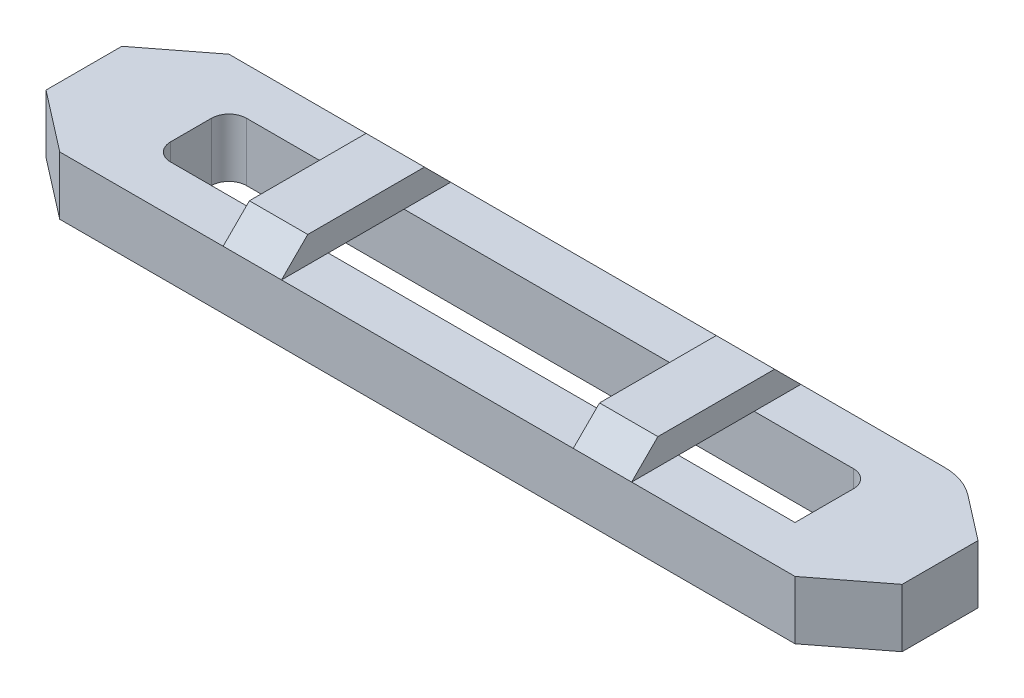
ISO-10303-21;
HEADER;
FILE_DESCRIPTION(('STEP AP214'),'2;1');
FILE_NAME('part.step','',(''),(''),'','','');
FILE_SCHEMA(('AUTOMOTIVE_DESIGN { 1 0 10303 214 1 1 1 1 }'));
ENDSEC;
DATA;
#1=APPLICATION_CONTEXT('core data for automotive mechanical design processes');
#2=APPLICATION_PROTOCOL_DEFINITION('international standard','automotive_design',2000,#1);
#3=PRODUCT_CONTEXT('',#1,'mechanical');
#4=PRODUCT('Part','Part','',(#3));
#5=PRODUCT_RELATED_PRODUCT_CATEGORY('part','',(#4));
#6=PRODUCT_DEFINITION_FORMATION('','',#4);
#7=PRODUCT_DEFINITION_CONTEXT('part definition',#1,'design');
#8=PRODUCT_DEFINITION('design','',#6,#7);
#9=PRODUCT_DEFINITION_SHAPE('','',#8);
#10=(LENGTH_UNIT() NAMED_UNIT(*) SI_UNIT(.MILLI.,.METRE.));
#11=(NAMED_UNIT(*) PLANE_ANGLE_UNIT() SI_UNIT($,.RADIAN.));
#12=(NAMED_UNIT(*) SI_UNIT($,.STERADIAN.) SOLID_ANGLE_UNIT());
#13=UNCERTAINTY_MEASURE_WITH_UNIT(LENGTH_MEASURE(1.E-05),#10,'distance_accuracy_value','');
#14=(GEOMETRIC_REPRESENTATION_CONTEXT(3) GLOBAL_UNCERTAINTY_ASSIGNED_CONTEXT((#13)) GLOBAL_UNIT_ASSIGNED_CONTEXT((#10,
#11,#12)) REPRESENTATION_CONTEXT('',''));
#15=CARTESIAN_POINT('',(0.,0.,0.));
#16=DIRECTION('',(0.,0.,1.));
#17=DIRECTION('',(1.,0.,0.));
#18=AXIS2_PLACEMENT_3D('',#15,#16,#17);
#19=CARTESIAN_POINT('',(-81.7701905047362,10.,0.));
#20=DIRECTION('',(0.,-1.,0.));
#21=DIRECTION('',(0.,0.,-1.));
#22=AXIS2_PLACEMENT_3D('',#19,#20,#21);
#23=PLANE('',#22);
#24=DIRECTION('',(0.,0.,-1.));
#25=VECTOR('',#24,1.);
#26=CARTESIAN_POINT('',(-35.,10.,14.5));
#27=LINE('',#26,#25);
#28=CARTESIAN_POINT('',(-35.,10.,-6.5));
#29=VERTEX_POINT('',#28);
#30=CARTESIAN_POINT('',(-35.,10.,-14.5));
#31=VERTEX_POINT('',#30);
#32=EDGE_CURVE('E243',#29,#31,#27,.T.);
#33=ORIENTED_EDGE('',*,*,#32,.T.);
#34=DIRECTION('',(-1.,0.,0.));
#35=VECTOR('',#34,1.);
#36=CARTESIAN_POINT('',(-63.,10.,-14.5));
#37=LINE('',#36,#35);
#38=CARTESIAN_POINT('',(-63.,10.,-14.5));
#39=VERTEX_POINT('',#38);
#40=EDGE_CURVE('E407',#31,#39,#37,.T.);
#41=ORIENTED_EDGE('',*,*,#40,.T.);
#42=DIRECTION('',(-0.79137144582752,0.,0.611335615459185));
#43=VECTOR('',#42,1.);
#44=CARTESIAN_POINT('',(-63.,10.,-14.5));
#45=LINE('',#44,#43);
#46=CARTESIAN_POINT('',(-73.3559671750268,10.,-6.5));
#47=VERTEX_POINT('',#46);
#48=EDGE_CURVE('E736',#39,#47,#45,.T.);
#49=ORIENTED_EDGE('',*,*,#48,.T.);
#50=DIRECTION('',(0.,0.,1.));
#51=VECTOR('',#50,1.);
#52=CARTESIAN_POINT('',(-73.3559671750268,10.,-6.5));
#53=LINE('',#52,#51);
#54=CARTESIAN_POINT('',(-73.3559671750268,10.,6.5));
#55=VERTEX_POINT('',#54);
#56=EDGE_CURVE('E735',#47,#55,#53,.T.);
#57=ORIENTED_EDGE('',*,*,#56,.T.);
#58=DIRECTION('',(0.79137144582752,0.,0.611335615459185));
#59=VECTOR('',#58,1.);
#60=CARTESIAN_POINT('',(-63.,10.,14.5));
#61=LINE('',#60,#59);
#62=CARTESIAN_POINT('',(-63.,10.,14.5));
#63=VERTEX_POINT('',#62);
#64=EDGE_CURVE('E384',#55,#63,#61,.T.);
#65=ORIENTED_EDGE('',*,*,#64,.T.);
#66=DIRECTION('',(1.,0.,0.));
#67=VECTOR('',#66,1.);
#68=CARTESIAN_POINT('',(-63.,10.,14.5));
#69=LINE('',#68,#67);
#70=CARTESIAN_POINT('',(-35.,10.,14.5));
#71=VERTEX_POINT('',#70);
#72=EDGE_CURVE('E382',#63,#71,#69,.T.);
#73=ORIENTED_EDGE('',*,*,#72,.T.);
#74=CARTESIAN_POINT('',(-35.,10.,6.5));
#75=VERTEX_POINT('',#74);
#76=EDGE_CURVE('E236',#71,#75,#27,.T.);
#77=ORIENTED_EDGE('',*,*,#76,.T.);
#78=DIRECTION('',(1.,0.,0.));
#79=VECTOR('',#78,1.);
#80=CARTESIAN_POINT('',(-52.,10.,6.5));
#81=LINE('',#80,#79);
#82=CARTESIAN_POINT('',(-52.,10.,6.5));
#83=VERTEX_POINT('',#82);
#84=EDGE_CURVE('E358',#83,#75,#81,.T.);
#85=ORIENTED_EDGE('',*,*,#84,.F.);
#86=CARTESIAN_POINT('',(-52.,10.,3.5));
#87=DIRECTION('',(0.,1.,0.));
#88=DIRECTION('',(0.,0.,1.));
#89=AXIS2_PLACEMENT_3D('',#86,#87,#88);
#90=CIRCLE('',#89,3.);
#91=CARTESIAN_POINT('',(-55.,10.,3.49999999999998));
#92=VERTEX_POINT('',#91);
#93=EDGE_CURVE('E360',#92,#83,#90,.T.);
#94=ORIENTED_EDGE('',*,*,#93,.F.);
#95=DIRECTION('',(0.,0.,1.));
#96=VECTOR('',#95,1.);
#97=CARTESIAN_POINT('',(-55.,10.,-3.49999999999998));
#98=LINE('',#97,#96);
#99=CARTESIAN_POINT('',(-55.,10.,-3.49999999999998));
#100=VERTEX_POINT('',#99);
#101=EDGE_CURVE('E790',#100,#92,#98,.T.);
#102=ORIENTED_EDGE('',*,*,#101,.F.);
#103=CARTESIAN_POINT('',(-52.,10.,-3.5));
#104=DIRECTION('',(0.,1.,0.));
#105=DIRECTION('',(0.,0.,-1.));
#106=AXIS2_PLACEMENT_3D('',#103,#104,#105);
#107=CIRCLE('',#106,3.);
#108=CARTESIAN_POINT('',(-52.,10.,-6.5));
#109=VERTEX_POINT('',#108);
#110=EDGE_CURVE('E787',#109,#100,#107,.T.);
#111=ORIENTED_EDGE('',*,*,#110,.F.);
#112=DIRECTION('',(-1.,0.,0.));
#113=VECTOR('',#112,1.);
#114=CARTESIAN_POINT('',(-52.,10.,-6.5));
#115=LINE('',#114,#113);
#116=EDGE_CURVE('E780',#29,#109,#115,.T.);
#117=ORIENTED_EDGE('',*,*,#116,.F.);
#118=EDGE_LOOP('',(#33,#41,#49,#57,#65,#73,#77,#85,#94,#102,#111,#117));
#119=FACE_BOUND('',#118,.T.);
#120=ADVANCED_FACE('F30',(#119),#23,.F.);
#121=CARTESIAN_POINT('',(25.,10.,-14.5));
#122=VERTEX_POINT('',#121);
#123=CARTESIAN_POINT('',(-25.,10.,-14.5));
#124=VERTEX_POINT('',#123);
#125=EDGE_CURVE('E412',#122,#124,#37,.T.);
#126=ORIENTED_EDGE('',*,*,#125,.T.);
#127=DIRECTION('',(0.,0.,-1.));
#128=VECTOR('',#127,1.);
#129=CARTESIAN_POINT('',(-25.,10.,14.5));
#130=LINE('',#129,#128);
#131=CARTESIAN_POINT('',(-25.,10.,-6.5));
#132=VERTEX_POINT('',#131);
#133=EDGE_CURVE('E255',#132,#124,#130,.T.);
#134=ORIENTED_EDGE('',*,*,#133,.F.);
#135=CARTESIAN_POINT('',(25.,10.,-6.5));
#136=VERTEX_POINT('',#135);
#137=EDGE_CURVE('E804',#136,#132,#115,.T.);
#138=ORIENTED_EDGE('',*,*,#137,.F.);
#139=DIRECTION('',(0.,0.,-1.));
#140=VECTOR('',#139,1.);
#141=CARTESIAN_POINT('',(25.,10.,14.5));
#142=LINE('',#141,#140);
#143=EDGE_CURVE('E308',#136,#122,#142,.T.);
#144=ORIENTED_EDGE('',*,*,#143,.T.);
#145=EDGE_LOOP('',(#126,#134,#138,#144));
#146=FACE_BOUND('',#145,.T.);
#147=ADVANCED_FACE('F460',(#146),#23,.F.);
#148=DIRECTION('',(-0.79137144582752,0.,-0.611335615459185));
#149=VECTOR('',#148,1.);
#150=CARTESIAN_POINT('',(63.,10.,-14.5));
#151=LINE('',#150,#149);
#152=CARTESIAN_POINT('',(73.3559671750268,10.,-6.5));
#153=VERTEX_POINT('',#152);
#154=CARTESIAN_POINT('',(65.7006880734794,10.,-12.4137144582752));
#155=VERTEX_POINT('',#154);
#156=EDGE_CURVE('E417',#153,#155,#151,.T.);
#157=ORIENTED_EDGE('',*,*,#156,.T.);
#158=CARTESIAN_POINT('',(59.5873319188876,10.,-4.5));
#159=DIRECTION('',(0.,-1.,0.));
#160=DIRECTION('',(0.,0.,-1.));
#161=AXIS2_PLACEMENT_3D('',#158,#159,#160);
#162=CIRCLE('',#161,10.);
#163=CARTESIAN_POINT('',(59.5873319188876,10.,-14.5));
#164=VERTEX_POINT('',#163);
#165=EDGE_CURVE('E11',#155,#164,#162,.F.);
#166=ORIENTED_EDGE('',*,*,#165,.T.);
#167=CARTESIAN_POINT('',(35.,10.,-14.5));
#168=VERTEX_POINT('',#167);
#169=EDGE_CURVE('E409',#164,#168,#37,.T.);
#170=ORIENTED_EDGE('',*,*,#169,.T.);
#171=DIRECTION('',(0.,0.,-1.));
#172=VECTOR('',#171,1.);
#173=CARTESIAN_POINT('',(35.,10.,14.5));
#174=LINE('',#173,#172);
#175=CARTESIAN_POINT('',(35.,10.,-6.5));
#176=VERTEX_POINT('',#175);
#177=EDGE_CURVE('E275',#176,#168,#174,.T.);
#178=ORIENTED_EDGE('',*,*,#177,.F.);
#179=CARTESIAN_POINT('',(52.,10.,-6.5));
#180=VERTEX_POINT('',#179);
#181=EDGE_CURVE('E784',#180,#176,#115,.T.);
#182=ORIENTED_EDGE('',*,*,#181,.F.);
#183=CARTESIAN_POINT('',(52.,10.,-3.5));
#184=DIRECTION('',(0.,1.,0.));
#185=DIRECTION('',(0.,0.,1.));
#186=AXIS2_PLACEMENT_3D('',#183,#184,#185);
#187=CIRCLE('',#186,3.);
#188=CARTESIAN_POINT('',(55.,10.,-3.49999999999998));
#189=VERTEX_POINT('',#188);
#190=EDGE_CURVE('E778',#189,#180,#187,.T.);
#191=ORIENTED_EDGE('',*,*,#190,.F.);
#192=DIRECTION('',(0.,0.,-1.));
#193=VECTOR('',#192,1.);
#194=CARTESIAN_POINT('',(55.,10.,-3.49999999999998));
#195=LINE('',#194,#193);
#196=CARTESIAN_POINT('',(55.,10.,6.5));
#197=VERTEX_POINT('',#196);
#198=EDGE_CURVE('E756',#197,#189,#195,.T.);
#199=ORIENTED_EDGE('',*,*,#198,.F.);
#200=CARTESIAN_POINT('',(35.,10.,6.5));
#201=VERTEX_POINT('',#200);
#202=EDGE_CURVE('E356',#201,#197,#81,.T.);
#203=ORIENTED_EDGE('',*,*,#202,.F.);
#204=CARTESIAN_POINT('',(35.,10.,14.5));
#205=VERTEX_POINT('',#204);
#206=EDGE_CURVE('E269',#205,#201,#174,.T.);
#207=ORIENTED_EDGE('',*,*,#206,.F.);
#208=CARTESIAN_POINT('',(63.,10.,14.5));
#209=VERTEX_POINT('',#208);
#210=EDGE_CURVE('E392',#205,#209,#69,.T.);
#211=ORIENTED_EDGE('',*,*,#210,.T.);
#212=DIRECTION('',(0.79137144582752,0.,-0.611335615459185));
#213=VECTOR('',#212,1.);
#214=CARTESIAN_POINT('',(63.,10.,14.5));
#215=LINE('',#214,#213);
#216=CARTESIAN_POINT('',(73.3559671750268,10.,6.5));
#217=VERTEX_POINT('',#216);
#218=EDGE_CURVE('E388',#209,#217,#215,.T.);
#219=ORIENTED_EDGE('',*,*,#218,.T.);
#220=DIRECTION('',(0.,0.,-1.));
#221=VECTOR('',#220,1.);
#222=CARTESIAN_POINT('',(73.3559671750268,10.,-6.5));
#223=LINE('',#222,#221);
#224=EDGE_CURVE('E390',#217,#153,#223,.T.);
#225=ORIENTED_EDGE('',*,*,#224,.T.);
#226=EDGE_LOOP('',(#157,#166,#170,#178,#182,#191,#199,#203,#207,#211,#219,#225));
#227=FACE_BOUND('',#226,.T.);
#228=ADVANCED_FACE('F433',(#227),#23,.F.);
#229=CARTESIAN_POINT('',(-25.,10.,6.5));
#230=VERTEX_POINT('',#229);
#231=CARTESIAN_POINT('',(25.,10.,6.5));
#232=VERTEX_POINT('',#231);
#233=EDGE_CURVE('E345',#230,#232,#81,.T.);
#234=ORIENTED_EDGE('',*,*,#233,.F.);
#235=CARTESIAN_POINT('',(-25.,10.,14.5));
#236=VERTEX_POINT('',#235);
#237=EDGE_CURVE('E238',#236,#230,#130,.T.);
#238=ORIENTED_EDGE('',*,*,#237,.F.);
#239=CARTESIAN_POINT('',(25.,10.,14.5));
#240=VERTEX_POINT('',#239);
#241=EDGE_CURVE('E348',#236,#240,#69,.T.);
#242=ORIENTED_EDGE('',*,*,#241,.T.);
#243=EDGE_CURVE('E297',#240,#232,#142,.T.);
#244=ORIENTED_EDGE('',*,*,#243,.T.);
#245=EDGE_LOOP('',(#234,#238,#242,#244));
#246=FACE_BOUND('',#245,.T.);
#247=ADVANCED_FACE('F343',(#246),#23,.F.);
#248=CARTESIAN_POINT('',(-81.7701905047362,0.,0.));
#249=DIRECTION('',(0.,-1.,0.));
#250=DIRECTION('',(0.,0.,-1.));
#251=AXIS2_PLACEMENT_3D('',#248,#249,#250);
#252=PLANE('',#251);
#253=DIRECTION('',(-1.,0.,0.));
#254=VECTOR('',#253,1.);
#255=CARTESIAN_POINT('',(-63.,0.,-14.5));
#256=LINE('',#255,#254);
#257=CARTESIAN_POINT('',(59.5873319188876,0.,-14.5));
#258=VERTEX_POINT('',#257);
#259=CARTESIAN_POINT('',(-63.,0.,-14.5));
#260=VERTEX_POINT('',#259);
#261=EDGE_CURVE('E738',#258,#260,#256,.T.);
#262=ORIENTED_EDGE('',*,*,#261,.F.);
#263=CARTESIAN_POINT('',(59.5873319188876,0.,-4.5));
#264=DIRECTION('',(0.,-1.,0.));
#265=DIRECTION('',(0.,0.,-1.));
#266=AXIS2_PLACEMENT_3D('',#263,#264,#265);
#267=CIRCLE('',#266,10.);
#268=CARTESIAN_POINT('',(65.7006880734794,0.,-12.4137144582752));
#269=VERTEX_POINT('',#268);
#270=EDGE_CURVE('E52',#258,#269,#267,.T.);
#271=ORIENTED_EDGE('',*,*,#270,.T.);
#272=DIRECTION('',(-0.79137144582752,0.,-0.611335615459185));
#273=VECTOR('',#272,1.);
#274=CARTESIAN_POINT('',(63.,0.,-14.5));
#275=LINE('',#274,#273);
#276=CARTESIAN_POINT('',(73.3559671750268,0.,-6.5));
#277=VERTEX_POINT('',#276);
#278=EDGE_CURVE('E446',#277,#269,#275,.T.);
#279=ORIENTED_EDGE('',*,*,#278,.F.);
#280=DIRECTION('',(0.,0.,-1.));
#281=VECTOR('',#280,1.);
#282=CARTESIAN_POINT('',(73.3559671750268,0.,-6.5));
#283=LINE('',#282,#281);
#284=CARTESIAN_POINT('',(73.3559671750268,0.,6.5));
#285=VERTEX_POINT('',#284);
#286=EDGE_CURVE('E442',#285,#277,#283,.T.);
#287=ORIENTED_EDGE('',*,*,#286,.F.);
#288=DIRECTION('',(0.79137144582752,0.,-0.611335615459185));
#289=VECTOR('',#288,1.);
#290=CARTESIAN_POINT('',(63.,0.,14.5));
#291=LINE('',#290,#289);
#292=CARTESIAN_POINT('',(63.,0.,14.5));
#293=VERTEX_POINT('',#292);
#294=EDGE_CURVE('E826',#293,#285,#291,.T.);
#295=ORIENTED_EDGE('',*,*,#294,.F.);
#296=DIRECTION('',(1.,0.,0.));
#297=VECTOR('',#296,1.);
#298=CARTESIAN_POINT('',(-63.,0.,14.5));
#299=LINE('',#298,#297);
#300=CARTESIAN_POINT('',(-63.,0.,14.5));
#301=VERTEX_POINT('',#300);
#302=EDGE_CURVE('E828',#301,#293,#299,.T.);
#303=ORIENTED_EDGE('',*,*,#302,.F.);
#304=DIRECTION('',(0.79137144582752,0.,0.611335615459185));
#305=VECTOR('',#304,1.);
#306=CARTESIAN_POINT('',(-63.,0.,14.5));
#307=LINE('',#306,#305);
#308=CARTESIAN_POINT('',(-73.3559671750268,0.,6.5));
#309=VERTEX_POINT('',#308);
#310=EDGE_CURVE('E830',#309,#301,#307,.T.);
#311=ORIENTED_EDGE('',*,*,#310,.F.);
#312=DIRECTION('',(0.,0.,1.));
#313=VECTOR('',#312,1.);
#314=CARTESIAN_POINT('',(-73.3559671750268,0.,-6.5));
#315=LINE('',#314,#313);
#316=CARTESIAN_POINT('',(-73.3559671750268,0.,-6.5));
#317=VERTEX_POINT('',#316);
#318=EDGE_CURVE('E831',#317,#309,#315,.T.);
#319=ORIENTED_EDGE('',*,*,#318,.F.);
#320=DIRECTION('',(-0.79137144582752,0.,0.611335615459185));
#321=VECTOR('',#320,1.);
#322=CARTESIAN_POINT('',(-63.,0.,-14.5));
#323=LINE('',#322,#321);
#324=EDGE_CURVE('E418',#260,#317,#323,.T.);
#325=ORIENTED_EDGE('',*,*,#324,.F.);
#326=EDGE_LOOP('',(#262,#271,#279,#287,#295,#303,#311,#319,#325));
#327=FACE_BOUND('',#326,.T.);
#328=DIRECTION('',(1.,0.,0.));
#329=VECTOR('',#328,1.);
#330=CARTESIAN_POINT('',(-52.,0.,6.5));
#331=LINE('',#330,#329);
#332=CARTESIAN_POINT('',(-52.,0.,6.5));
#333=VERTEX_POINT('',#332);
#334=CARTESIAN_POINT('',(55.,0.,6.5));
#335=VERTEX_POINT('',#334);
#336=EDGE_CURVE('E753',#333,#335,#331,.T.);
#337=ORIENTED_EDGE('',*,*,#336,.T.);
#338=DIRECTION('',(0.,0.,-1.));
#339=VECTOR('',#338,1.);
#340=CARTESIAN_POINT('',(55.,0.,-3.49999999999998));
#341=LINE('',#340,#339);
#342=CARTESIAN_POINT('',(55.,0.,-3.49999999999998));
#343=VERTEX_POINT('',#342);
#344=EDGE_CURVE('E293',#335,#343,#341,.T.);
#345=ORIENTED_EDGE('',*,*,#344,.T.);
#346=CARTESIAN_POINT('',(52.,0.,-3.5));
#347=DIRECTION('',(0.,1.,0.));
#348=DIRECTION('',(0.,0.,1.));
#349=AXIS2_PLACEMENT_3D('',#346,#347,#348);
#350=CIRCLE('',#349,3.);
#351=CARTESIAN_POINT('',(52.,0.,-6.5));
#352=VERTEX_POINT('',#351);
#353=EDGE_CURVE('E769',#343,#352,#350,.T.);
#354=ORIENTED_EDGE('',*,*,#353,.T.);
#355=DIRECTION('',(-1.,0.,0.));
#356=VECTOR('',#355,1.);
#357=CARTESIAN_POINT('',(-52.,0.,-6.5));
#358=LINE('',#357,#356);
#359=CARTESIAN_POINT('',(-52.,0.,-6.5));
#360=VERTEX_POINT('',#359);
#361=EDGE_CURVE('E766',#352,#360,#358,.T.);
#362=ORIENTED_EDGE('',*,*,#361,.T.);
#363=CARTESIAN_POINT('',(-52.,0.,-3.5));
#364=DIRECTION('',(0.,1.,0.));
#365=DIRECTION('',(0.,0.,-1.));
#366=AXIS2_PLACEMENT_3D('',#363,#364,#365);
#367=CIRCLE('',#366,3.);
#368=CARTESIAN_POINT('',(-55.,0.,-3.49999999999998));
#369=VERTEX_POINT('',#368);
#370=EDGE_CURVE('E763',#360,#369,#367,.T.);
#371=ORIENTED_EDGE('',*,*,#370,.T.);
#372=DIRECTION('',(0.,0.,1.));
#373=VECTOR('',#372,1.);
#374=CARTESIAN_POINT('',(-55.,0.,-3.49999999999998));
#375=LINE('',#374,#373);
#376=CARTESIAN_POINT('',(-55.,0.,3.49999999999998));
#377=VERTEX_POINT('',#376);
#378=EDGE_CURVE('E760',#369,#377,#375,.T.);
#379=ORIENTED_EDGE('',*,*,#378,.T.);
#380=CARTESIAN_POINT('',(-52.,0.,3.5));
#381=DIRECTION('',(0.,1.,0.));
#382=DIRECTION('',(0.,0.,1.));
#383=AXIS2_PLACEMENT_3D('',#380,#381,#382);
#384=CIRCLE('',#383,3.);
#385=EDGE_CURVE('E757',#377,#333,#384,.T.);
#386=ORIENTED_EDGE('',*,*,#385,.T.);
#387=EDGE_LOOP('',(#337,#345,#354,#362,#371,#379,#386));
#388=FACE_BOUND('',#387,.T.);
#389=ADVANCED_FACE('F468',(#327,#388),#252,.T.);
#390=CARTESIAN_POINT('',(-63.,10.,-14.5));
#391=DIRECTION('',(0.611335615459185,0.,0.79137144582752));
#392=DIRECTION('',(0.79137144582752,0.,-0.611335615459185));
#393=AXIS2_PLACEMENT_3D('',#390,#391,#392);
#394=PLANE('',#393);
#395=ORIENTED_EDGE('',*,*,#324,.T.);
#396=DIRECTION('',(0.,-1.,0.));
#397=VECTOR('',#396,1.);
#398=CARTESIAN_POINT('',(-73.3559671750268,10.,-6.5));
#399=LINE('',#398,#397);
#400=EDGE_CURVE('E397',#47,#317,#399,.T.);
#401=ORIENTED_EDGE('',*,*,#400,.F.);
#402=ORIENTED_EDGE('',*,*,#48,.F.);
#403=DIRECTION('',(0.,-1.,0.));
#404=VECTOR('',#403,1.);
#405=CARTESIAN_POINT('',(-63.,10.,-14.5));
#406=LINE('',#405,#404);
#407=EDGE_CURVE('E411',#39,#260,#406,.T.);
#408=ORIENTED_EDGE('',*,*,#407,.T.);
#409=EDGE_LOOP('',(#395,#401,#402,#408));
#410=FACE_BOUND('',#409,.T.);
#411=ADVANCED_FACE('F473',(#410),#394,.F.);
#412=CARTESIAN_POINT('',(-73.3559671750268,10.,-6.5));
#413=DIRECTION('',(1.,0.,0.));
#414=DIRECTION('',(0.,0.,-1.));
#415=AXIS2_PLACEMENT_3D('',#412,#413,#414);
#416=PLANE('',#415);
#417=ORIENTED_EDGE('',*,*,#318,.T.);
#418=DIRECTION('',(0.,-1.,0.));
#419=VECTOR('',#418,1.);
#420=CARTESIAN_POINT('',(-73.3559671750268,10.,6.5));
#421=LINE('',#420,#419);
#422=EDGE_CURVE('E811',#55,#309,#421,.T.);
#423=ORIENTED_EDGE('',*,*,#422,.F.);
#424=ORIENTED_EDGE('',*,*,#56,.F.);
#425=ORIENTED_EDGE('',*,*,#400,.T.);
#426=EDGE_LOOP('',(#417,#423,#424,#425));
#427=FACE_BOUND('',#426,.T.);
#428=ADVANCED_FACE('F619',(#427),#416,.F.);
#429=CARTESIAN_POINT('',(-63.,10.,14.5));
#430=DIRECTION('',(0.611335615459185,0.,-0.79137144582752));
#431=DIRECTION('',(-0.79137144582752,0.,-0.611335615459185));
#432=AXIS2_PLACEMENT_3D('',#429,#430,#431);
#433=PLANE('',#432);
#434=ORIENTED_EDGE('',*,*,#310,.T.);
#435=DIRECTION('',(0.,-1.,0.));
#436=VECTOR('',#435,1.);
#437=CARTESIAN_POINT('',(-63.,10.,14.5));
#438=LINE('',#437,#436);
#439=EDGE_CURVE('E815',#63,#301,#438,.T.);
#440=ORIENTED_EDGE('',*,*,#439,.F.);
#441=ORIENTED_EDGE('',*,*,#64,.F.);
#442=ORIENTED_EDGE('',*,*,#422,.T.);
#443=EDGE_LOOP('',(#434,#440,#441,#442));
#444=FACE_BOUND('',#443,.T.);
#445=ADVANCED_FACE('F501',(#444),#433,.F.);
#446=CARTESIAN_POINT('',(-63.,10.,14.5));
#447=DIRECTION('',(0.,0.,-1.));
#448=DIRECTION('',(-1.,0.,0.));
#449=AXIS2_PLACEMENT_3D('',#446,#447,#448);
#450=PLANE('',#449);
#451=ORIENTED_EDGE('',*,*,#302,.T.);
#452=DIRECTION('',(0.,-1.,0.));
#453=VECTOR('',#452,1.);
#454=CARTESIAN_POINT('',(63.,10.,14.5));
#455=LINE('',#454,#453);
#456=EDGE_CURVE('E734',#209,#293,#455,.T.);
#457=ORIENTED_EDGE('',*,*,#456,.F.);
#458=ORIENTED_EDGE('',*,*,#210,.F.);
#459=DIRECTION('',(-1.,0.,0.));
#460=VECTOR('',#459,1.);
#461=CARTESIAN_POINT('',(35.,10.,14.5));
#462=LINE('',#461,#460);
#463=EDGE_CURVE('E290',#205,#240,#462,.T.);
#464=ORIENTED_EDGE('',*,*,#463,.T.);
#465=ORIENTED_EDGE('',*,*,#241,.F.);
#466=DIRECTION('',(1.,0.,0.));
#467=VECTOR('',#466,1.);
#468=CARTESIAN_POINT('',(-35.,10.,14.5));
#469=LINE('',#468,#467);
#470=EDGE_CURVE('E247',#71,#236,#469,.T.);
#471=ORIENTED_EDGE('',*,*,#470,.F.);
#472=ORIENTED_EDGE('',*,*,#72,.F.);
#473=ORIENTED_EDGE('',*,*,#439,.T.);
#474=EDGE_LOOP('',(#451,#457,#458,#464,#465,#471,#472,#473));
#475=FACE_BOUND('',#474,.T.);
#476=ADVANCED_FACE('F496',(#475),#450,.F.);
#477=CARTESIAN_POINT('',(63.,10.,14.5));
#478=DIRECTION('',(-0.611335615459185,0.,-0.79137144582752));
#479=DIRECTION('',(-0.79137144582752,0.,0.611335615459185));
#480=AXIS2_PLACEMENT_3D('',#477,#478,#479);
#481=PLANE('',#480);
#482=ORIENTED_EDGE('',*,*,#294,.T.);
#483=DIRECTION('',(0.,-1.,0.));
#484=VECTOR('',#483,1.);
#485=CARTESIAN_POINT('',(73.3559671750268,10.,6.5));
#486=LINE('',#485,#484);
#487=EDGE_CURVE('E443',#217,#285,#486,.T.);
#488=ORIENTED_EDGE('',*,*,#487,.F.);
#489=ORIENTED_EDGE('',*,*,#218,.F.);
#490=ORIENTED_EDGE('',*,*,#456,.T.);
#491=EDGE_LOOP('',(#482,#488,#489,#490));
#492=FACE_BOUND('',#491,.T.);
#493=ADVANCED_FACE('F457',(#492),#481,.F.);
#494=CARTESIAN_POINT('',(73.3559671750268,10.,-6.5));
#495=DIRECTION('',(-1.,0.,0.));
#496=DIRECTION('',(0.,0.,1.));
#497=AXIS2_PLACEMENT_3D('',#494,#495,#496);
#498=PLANE('',#497);
#499=ORIENTED_EDGE('',*,*,#286,.T.);
#500=DIRECTION('',(0.,-1.,0.));
#501=VECTOR('',#500,1.);
#502=CARTESIAN_POINT('',(73.3559671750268,10.,-6.5));
#503=LINE('',#502,#501);
#504=EDGE_CURVE('E439',#153,#277,#503,.T.);
#505=ORIENTED_EDGE('',*,*,#504,.F.);
#506=ORIENTED_EDGE('',*,*,#224,.F.);
#507=ORIENTED_EDGE('',*,*,#487,.T.);
#508=EDGE_LOOP('',(#499,#505,#506,#507));
#509=FACE_BOUND('',#508,.T.);
#510=ADVANCED_FACE('F440',(#509),#498,.F.);
#511=CARTESIAN_POINT('',(63.,10.,-14.5));
#512=DIRECTION('',(-0.611335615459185,0.,0.79137144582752));
#513=DIRECTION('',(0.79137144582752,0.,0.611335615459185));
#514=AXIS2_PLACEMENT_3D('',#511,#512,#513);
#515=PLANE('',#514);
#516=ORIENTED_EDGE('',*,*,#278,.T.);
#517=DIRECTION('',(0.,-1.,0.));
#518=VECTOR('',#517,1.);
#519=CARTESIAN_POINT('',(65.7006880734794,10.,-12.4137144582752));
#520=LINE('',#519,#518);
#521=EDGE_CURVE('E38',#269,#155,#520,.F.);
#522=ORIENTED_EDGE('',*,*,#521,.T.);
#523=ORIENTED_EDGE('',*,*,#156,.F.);
#524=ORIENTED_EDGE('',*,*,#504,.T.);
#525=EDGE_LOOP('',(#516,#522,#523,#524));
#526=FACE_BOUND('',#525,.T.);
#527=ADVANCED_FACE('F445',(#526),#515,.F.);
#528=CARTESIAN_POINT('',(-63.,10.,-14.5));
#529=DIRECTION('',(0.,0.,1.));
#530=DIRECTION('',(1.,0.,0.));
#531=AXIS2_PLACEMENT_3D('',#528,#529,#530);
#532=PLANE('',#531);
#533=ORIENTED_EDGE('',*,*,#169,.F.);
#534=DIRECTION('',(0.,-1.,0.));
#535=VECTOR('',#534,1.);
#536=CARTESIAN_POINT('',(59.5873319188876,10.,-14.5));
#537=LINE('',#536,#535);
#538=EDGE_CURVE('E310',#164,#258,#537,.T.);
#539=ORIENTED_EDGE('',*,*,#538,.T.);
#540=ORIENTED_EDGE('',*,*,#261,.T.);
#541=ORIENTED_EDGE('',*,*,#407,.F.);
#542=ORIENTED_EDGE('',*,*,#40,.F.);
#543=DIRECTION('',(1.,0.,0.));
#544=VECTOR('',#543,1.);
#545=CARTESIAN_POINT('',(-35.,10.,-14.5));
#546=LINE('',#545,#544);
#547=EDGE_CURVE('E259',#31,#124,#546,.T.);
#548=ORIENTED_EDGE('',*,*,#547,.T.);
#549=ORIENTED_EDGE('',*,*,#125,.F.);
#550=DIRECTION('',(-1.,0.,0.));
#551=VECTOR('',#550,1.);
#552=CARTESIAN_POINT('',(35.,10.,-14.5));
#553=LINE('',#552,#551);
#554=EDGE_CURVE('E294',#168,#122,#553,.T.);
#555=ORIENTED_EDGE('',*,*,#554,.F.);
#556=EDGE_LOOP('',(#533,#539,#540,#541,#542,#548,#549,#555));
#557=FACE_BOUND('',#556,.T.);
#558=ADVANCED_FACE('F448',(#557),#532,.F.);
#559=CARTESIAN_POINT('',(55.,10.,-3.49999999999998));
#560=DIRECTION('',(-1.,0.,0.));
#561=DIRECTION('',(0.,0.,1.));
#562=AXIS2_PLACEMENT_3D('',#559,#560,#561);
#563=PLANE('',#562);
#564=ORIENTED_EDGE('',*,*,#344,.F.);
#565=DIRECTION('',(0.,-1.,0.));
#566=VECTOR('',#565,1.);
#567=CARTESIAN_POINT('',(55.,10.,6.5));
#568=LINE('',#567,#566);
#569=EDGE_CURVE('E364',#197,#335,#568,.T.);
#570=ORIENTED_EDGE('',*,*,#569,.F.);
#571=ORIENTED_EDGE('',*,*,#198,.T.);
#572=DIRECTION('',(0.,-1.,0.));
#573=VECTOR('',#572,1.);
#574=CARTESIAN_POINT('',(55.,10.,-3.49999999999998));
#575=LINE('',#574,#573);
#576=EDGE_CURVE('E741',#189,#343,#575,.T.);
#577=ORIENTED_EDGE('',*,*,#576,.T.);
#578=EDGE_LOOP('',(#564,#570,#571,#577));
#579=FACE_BOUND('',#578,.T.);
#580=ADVANCED_FACE('F454',(#579),#563,.T.);
#581=CARTESIAN_POINT('',(52.,10.,-3.5));
#582=DIRECTION('',(0.,-1.,0.));
#583=DIRECTION('',(0.,0.,-1.));
#584=AXIS2_PLACEMENT_3D('',#581,#582,#583);
#585=CYLINDRICAL_SURFACE('',#584,3.);
#586=ORIENTED_EDGE('',*,*,#353,.F.);
#587=ORIENTED_EDGE('',*,*,#576,.F.);
#588=ORIENTED_EDGE('',*,*,#190,.T.);
#589=DIRECTION('',(0.,-1.,0.));
#590=VECTOR('',#589,1.);
#591=CARTESIAN_POINT('',(52.,10.,-6.5));
#592=LINE('',#591,#590);
#593=EDGE_CURVE('E744',#180,#352,#592,.T.);
#594=ORIENTED_EDGE('',*,*,#593,.T.);
#595=EDGE_LOOP('',(#586,#587,#588,#594));
#596=FACE_BOUND('',#595,.T.);
#597=ADVANCED_FACE('F516',(#596),#585,.F.);
#598=CARTESIAN_POINT('',(-52.,10.,-6.5));
#599=DIRECTION('',(0.,0.,1.));
#600=DIRECTION('',(1.,0.,0.));
#601=AXIS2_PLACEMENT_3D('',#598,#599,#600);
#602=PLANE('',#601);
#603=ORIENTED_EDGE('',*,*,#361,.F.);
#604=ORIENTED_EDGE('',*,*,#593,.F.);
#605=ORIENTED_EDGE('',*,*,#181,.T.);
#606=EDGE_CURVE('E788',#176,#136,#115,.T.);
#607=ORIENTED_EDGE('',*,*,#606,.T.);
#608=ORIENTED_EDGE('',*,*,#137,.T.);
#609=DIRECTION('',(1.,0.,0.));
#610=VECTOR('',#609,1.);
#611=CARTESIAN_POINT('',(-52.,10.,-6.5));
#612=LINE('',#611,#610);
#613=EDGE_CURVE('E225',#29,#132,#612,.T.);
#614=ORIENTED_EDGE('',*,*,#613,.F.);
#615=ORIENTED_EDGE('',*,*,#116,.T.);
#616=DIRECTION('',(0.,-1.,0.));
#617=VECTOR('',#616,1.);
#618=CARTESIAN_POINT('',(-52.,10.,-6.5));
#619=LINE('',#618,#617);
#620=EDGE_CURVE('E746',#109,#360,#619,.T.);
#621=ORIENTED_EDGE('',*,*,#620,.T.);
#622=EDGE_LOOP('',(#603,#604,#605,#607,#608,#614,#615,#621));
#623=FACE_BOUND('',#622,.T.);
#624=ADVANCED_FACE('F510',(#623),#602,.T.);
#625=CARTESIAN_POINT('',(-52.,10.,-3.5));
#626=DIRECTION('',(0.,-1.,0.));
#627=DIRECTION('',(0.,0.,-1.));
#628=AXIS2_PLACEMENT_3D('',#625,#626,#627);
#629=CYLINDRICAL_SURFACE('',#628,3.);
#630=ORIENTED_EDGE('',*,*,#370,.F.);
#631=ORIENTED_EDGE('',*,*,#620,.F.);
#632=ORIENTED_EDGE('',*,*,#110,.T.);
#633=DIRECTION('',(0.,-1.,0.));
#634=VECTOR('',#633,1.);
#635=CARTESIAN_POINT('',(-55.,10.,-3.49999999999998));
#636=LINE('',#635,#634);
#637=EDGE_CURVE('E748',#100,#369,#636,.T.);
#638=ORIENTED_EDGE('',*,*,#637,.T.);
#639=EDGE_LOOP('',(#630,#631,#632,#638));
#640=FACE_BOUND('',#639,.T.);
#641=ADVANCED_FACE('F515',(#640),#629,.F.);
#642=CARTESIAN_POINT('',(-55.,10.,-3.49999999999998));
#643=DIRECTION('',(1.,0.,0.));
#644=DIRECTION('',(0.,0.,-1.));
#645=AXIS2_PLACEMENT_3D('',#642,#643,#644);
#646=PLANE('',#645);
#647=ORIENTED_EDGE('',*,*,#378,.F.);
#648=ORIENTED_EDGE('',*,*,#637,.F.);
#649=ORIENTED_EDGE('',*,*,#101,.T.);
#650=DIRECTION('',(0.,-1.,0.));
#651=VECTOR('',#650,1.);
#652=CARTESIAN_POINT('',(-55.,10.,3.49999999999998));
#653=LINE('',#652,#651);
#654=EDGE_CURVE('E750',#92,#377,#653,.T.);
#655=ORIENTED_EDGE('',*,*,#654,.T.);
#656=EDGE_LOOP('',(#647,#648,#649,#655));
#657=FACE_BOUND('',#656,.T.);
#658=ADVANCED_FACE('F663',(#657),#646,.T.);
#659=CARTESIAN_POINT('',(-52.,10.,3.5));
#660=DIRECTION('',(0.,-1.,0.));
#661=DIRECTION('',(0.,0.,-1.));
#662=AXIS2_PLACEMENT_3D('',#659,#660,#661);
#663=CYLINDRICAL_SURFACE('',#662,3.);
#664=ORIENTED_EDGE('',*,*,#385,.F.);
#665=ORIENTED_EDGE('',*,*,#654,.F.);
#666=ORIENTED_EDGE('',*,*,#93,.T.);
#667=DIRECTION('',(0.,-1.,0.));
#668=VECTOR('',#667,1.);
#669=CARTESIAN_POINT('',(-52.,10.,6.5));
#670=LINE('',#669,#668);
#671=EDGE_CURVE('E367',#83,#333,#670,.T.);
#672=ORIENTED_EDGE('',*,*,#671,.T.);
#673=EDGE_LOOP('',(#664,#665,#666,#672));
#674=FACE_BOUND('',#673,.T.);
#675=ADVANCED_FACE('F530',(#674),#663,.F.);
#676=CARTESIAN_POINT('',(-52.,10.,6.5));
#677=DIRECTION('',(0.,0.,-1.));
#678=DIRECTION('',(-1.,0.,0.));
#679=AXIS2_PLACEMENT_3D('',#676,#677,#678);
#680=PLANE('',#679);
#681=ORIENTED_EDGE('',*,*,#336,.F.);
#682=ORIENTED_EDGE('',*,*,#671,.F.);
#683=ORIENTED_EDGE('',*,*,#84,.T.);
#684=EDGE_CURVE('E359',#75,#230,#81,.T.);
#685=ORIENTED_EDGE('',*,*,#684,.T.);
#686=ORIENTED_EDGE('',*,*,#233,.T.);
#687=EDGE_CURVE('E351',#232,#201,#81,.T.);
#688=ORIENTED_EDGE('',*,*,#687,.T.);
#689=ORIENTED_EDGE('',*,*,#202,.T.);
#690=ORIENTED_EDGE('',*,*,#569,.T.);
#691=EDGE_LOOP('',(#681,#682,#683,#685,#686,#688,#689,#690));
#692=FACE_BOUND('',#691,.T.);
#693=ADVANCED_FACE('F370',(#692),#680,.T.);
#694=CARTESIAN_POINT('',(35.,14.5,10.));
#695=DIRECTION('',(0.,-0.707106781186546,-0.707106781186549));
#696=DIRECTION('',(0.,0.707106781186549,-0.707106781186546));
#697=AXIS2_PLACEMENT_3D('',#694,#695,#696);
#698=PLANE('',#697);
#699=DIRECTION('',(0.,-0.707106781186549,0.707106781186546));
#700=VECTOR('',#699,1.);
#701=CARTESIAN_POINT('',(25.,14.5,10.));
#702=LINE('',#701,#700);
#703=CARTESIAN_POINT('',(25.,14.5,10.));
#704=VERTEX_POINT('',#703);
#705=EDGE_CURVE('E264',#704,#240,#702,.T.);
#706=ORIENTED_EDGE('',*,*,#705,.T.);
#707=ORIENTED_EDGE('',*,*,#463,.F.);
#708=DIRECTION('',(0.,-0.707106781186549,0.707106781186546));
#709=VECTOR('',#708,1.);
#710=CARTESIAN_POINT('',(35.,14.5,10.));
#711=LINE('',#710,#709);
#712=CARTESIAN_POINT('',(35.,14.5,10.));
#713=VERTEX_POINT('',#712);
#714=EDGE_CURVE('E270',#713,#205,#711,.T.);
#715=ORIENTED_EDGE('',*,*,#714,.F.);
#716=DIRECTION('',(-1.,0.,0.));
#717=VECTOR('',#716,1.);
#718=CARTESIAN_POINT('',(35.,14.5,10.));
#719=LINE('',#718,#717);
#720=EDGE_CURVE('E328',#713,#704,#719,.T.);
#721=ORIENTED_EDGE('',*,*,#720,.T.);
#722=EDGE_LOOP('',(#706,#707,#715,#721));
#723=FACE_BOUND('',#722,.T.);
#724=ADVANCED_FACE('F334',(#723),#698,.F.);
#725=CARTESIAN_POINT('',(35.,10.,14.5));
#726=DIRECTION('',(0.,1.,0.));
#727=DIRECTION('',(0.,0.,1.));
#728=AXIS2_PLACEMENT_3D('',#725,#726,#727);
#729=PLANE('',#728);
#730=ORIENTED_EDGE('',*,*,#687,.F.);
#731=EDGE_CURVE('E301',#232,#136,#142,.T.);
#732=ORIENTED_EDGE('',*,*,#731,.T.);
#733=ORIENTED_EDGE('',*,*,#606,.F.);
#734=EDGE_CURVE('E265',#201,#176,#174,.T.);
#735=ORIENTED_EDGE('',*,*,#734,.F.);
#736=EDGE_LOOP('',(#730,#732,#733,#735));
#737=FACE_BOUND('',#736,.T.);
#738=ADVANCED_FACE('F352',(#737),#729,.F.);
#739=CARTESIAN_POINT('',(35.,10.,-14.5));
#740=DIRECTION('',(0.,-0.707106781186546,0.707106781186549));
#741=DIRECTION('',(0.,-0.707106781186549,-0.707106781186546));
#742=AXIS2_PLACEMENT_3D('',#739,#740,#741);
#743=PLANE('',#742);
#744=DIRECTION('',(0.,0.707106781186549,0.707106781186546));
#745=VECTOR('',#744,1.);
#746=CARTESIAN_POINT('',(25.,10.,-14.5));
#747=LINE('',#746,#745);
#748=CARTESIAN_POINT('',(25.,14.5,-10.));
#749=VERTEX_POINT('',#748);
#750=EDGE_CURVE('E300',#122,#749,#747,.T.);
#751=ORIENTED_EDGE('',*,*,#750,.T.);
#752=DIRECTION('',(-1.,0.,0.));
#753=VECTOR('',#752,1.);
#754=CARTESIAN_POINT('',(35.,14.5,-10.));
#755=LINE('',#754,#753);
#756=CARTESIAN_POINT('',(35.,14.5,-10.));
#757=VERTEX_POINT('',#756);
#758=EDGE_CURVE('E313',#757,#749,#755,.T.);
#759=ORIENTED_EDGE('',*,*,#758,.F.);
#760=DIRECTION('',(0.,0.707106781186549,0.707106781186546));
#761=VECTOR('',#760,1.);
#762=CARTESIAN_POINT('',(35.,10.,-14.5));
#763=LINE('',#762,#761);
#764=EDGE_CURVE('E282',#168,#757,#763,.T.);
#765=ORIENTED_EDGE('',*,*,#764,.F.);
#766=ORIENTED_EDGE('',*,*,#554,.T.);
#767=EDGE_LOOP('',(#751,#759,#765,#766));
#768=FACE_BOUND('',#767,.T.);
#769=ADVANCED_FACE('F696',(#768),#743,.F.);
#770=CARTESIAN_POINT('',(35.,14.5,-10.));
#771=DIRECTION('',(0.,-1.,0.));
#772=DIRECTION('',(0.,0.,-1.));
#773=AXIS2_PLACEMENT_3D('',#770,#771,#772);
#774=PLANE('',#773);
#775=DIRECTION('',(0.,0.,1.));
#776=VECTOR('',#775,1.);
#777=CARTESIAN_POINT('',(25.,14.5,-10.));
#778=LINE('',#777,#776);
#779=EDGE_CURVE('E287',#749,#704,#778,.T.);
#780=ORIENTED_EDGE('',*,*,#779,.T.);
#781=ORIENTED_EDGE('',*,*,#720,.F.);
#782=DIRECTION('',(0.,0.,1.));
#783=VECTOR('',#782,1.);
#784=CARTESIAN_POINT('',(35.,14.5,-10.));
#785=LINE('',#784,#783);
#786=EDGE_CURVE('E271',#757,#713,#785,.T.);
#787=ORIENTED_EDGE('',*,*,#786,.F.);
#788=ORIENTED_EDGE('',*,*,#758,.T.);
#789=EDGE_LOOP('',(#780,#781,#787,#788));
#790=FACE_BOUND('',#789,.T.);
#791=ADVANCED_FACE('F326',(#790),#774,.F.);
#792=CARTESIAN_POINT('',(35.,24.5000000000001,0.));
#793=DIRECTION('',(-1.,0.,0.));
#794=DIRECTION('',(0.,0.,1.));
#795=AXIS2_PLACEMENT_3D('',#792,#793,#794);
#796=PLANE('',#795);
#797=ORIENTED_EDGE('',*,*,#714,.T.);
#798=ORIENTED_EDGE('',*,*,#206,.T.);
#799=ORIENTED_EDGE('',*,*,#734,.T.);
#800=ORIENTED_EDGE('',*,*,#177,.T.);
#801=ORIENTED_EDGE('',*,*,#764,.T.);
#802=ORIENTED_EDGE('',*,*,#786,.T.);
#803=EDGE_LOOP('',(#797,#798,#799,#800,#801,#802));
#804=FACE_BOUND('',#803,.T.);
#805=ADVANCED_FACE('F713',(#804),#796,.F.);
#806=CARTESIAN_POINT('',(25.,24.5000000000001,0.));
#807=DIRECTION('',(-1.,0.,0.));
#808=DIRECTION('',(0.,0.,1.));
#809=AXIS2_PLACEMENT_3D('',#806,#807,#808);
#810=PLANE('',#809);
#811=ORIENTED_EDGE('',*,*,#705,.F.);
#812=ORIENTED_EDGE('',*,*,#779,.F.);
#813=ORIENTED_EDGE('',*,*,#750,.F.);
#814=ORIENTED_EDGE('',*,*,#143,.F.);
#815=ORIENTED_EDGE('',*,*,#731,.F.);
#816=ORIENTED_EDGE('',*,*,#243,.F.);
#817=EDGE_LOOP('',(#811,#812,#813,#814,#815,#816));
#818=FACE_BOUND('',#817,.T.);
#819=ADVANCED_FACE('F337',(#818),#810,.T.);
#820=CARTESIAN_POINT('',(-35.,14.5,10.));
#821=DIRECTION('',(0.,0.707106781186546,0.707106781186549));
#822=DIRECTION('',(0.,-0.707106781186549,0.707106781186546));
#823=AXIS2_PLACEMENT_3D('',#820,#821,#822);
#824=PLANE('',#823);
#825=DIRECTION('',(0.,-0.707106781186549,0.707106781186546));
#826=VECTOR('',#825,1.);
#827=CARTESIAN_POINT('',(-25.,14.5,10.));
#828=LINE('',#827,#826);
#829=CARTESIAN_POINT('',(-25.,14.5,10.));
#830=VERTEX_POINT('',#829);
#831=EDGE_CURVE('E220',#830,#236,#828,.T.);
#832=ORIENTED_EDGE('',*,*,#831,.F.);
#833=DIRECTION('',(1.,0.,0.));
#834=VECTOR('',#833,1.);
#835=CARTESIAN_POINT('',(-35.,14.5,10.));
#836=LINE('',#835,#834);
#837=CARTESIAN_POINT('',(-35.,14.5,10.));
#838=VERTEX_POINT('',#837);
#839=EDGE_CURVE('E214',#838,#830,#836,.T.);
#840=ORIENTED_EDGE('',*,*,#839,.F.);
#841=DIRECTION('',(0.,-0.707106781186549,0.707106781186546));
#842=VECTOR('',#841,1.);
#843=CARTESIAN_POINT('',(-35.,14.5,10.));
#844=LINE('',#843,#842);
#845=EDGE_CURVE('E217',#838,#71,#844,.T.);
#846=ORIENTED_EDGE('',*,*,#845,.T.);
#847=ORIENTED_EDGE('',*,*,#470,.T.);
#848=EDGE_LOOP('',(#832,#840,#846,#847));
#849=FACE_BOUND('',#848,.T.);
#850=ADVANCED_FACE('F216',(#849),#824,.T.);
#851=CARTESIAN_POINT('',(-35.,14.5,-10.));
#852=DIRECTION('',(0.,1.,0.));
#853=DIRECTION('',(0.,0.,1.));
#854=AXIS2_PLACEMENT_3D('',#851,#852,#853);
#855=PLANE('',#854);
#856=DIRECTION('',(0.,0.,1.));
#857=VECTOR('',#856,1.);
#858=CARTESIAN_POINT('',(-25.,14.5,-10.));
#859=LINE('',#858,#857);
#860=CARTESIAN_POINT('',(-25.,14.5,-10.));
#861=VERTEX_POINT('',#860);
#862=EDGE_CURVE('E250',#861,#830,#859,.T.);
#863=ORIENTED_EDGE('',*,*,#862,.F.);
#864=DIRECTION('',(1.,0.,0.));
#865=VECTOR('',#864,1.);
#866=CARTESIAN_POINT('',(-35.,14.5,-10.));
#867=LINE('',#866,#865);
#868=CARTESIAN_POINT('',(-35.,14.5,-10.));
#869=VERTEX_POINT('',#868);
#870=EDGE_CURVE('E226',#869,#861,#867,.T.);
#871=ORIENTED_EDGE('',*,*,#870,.F.);
#872=DIRECTION('',(0.,0.,1.));
#873=VECTOR('',#872,1.);
#874=CARTESIAN_POINT('',(-35.,14.5,-10.));
#875=LINE('',#874,#873);
#876=EDGE_CURVE('E232',#869,#838,#875,.T.);
#877=ORIENTED_EDGE('',*,*,#876,.T.);
#878=ORIENTED_EDGE('',*,*,#839,.T.);
#879=EDGE_LOOP('',(#863,#871,#877,#878));
#880=FACE_BOUND('',#879,.T.);
#881=ADVANCED_FACE('F240',(#880),#855,.T.);
#882=CARTESIAN_POINT('',(-35.,10.,-14.5));
#883=DIRECTION('',(0.,0.707106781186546,-0.707106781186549));
#884=DIRECTION('',(0.,0.707106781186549,0.707106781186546));
#885=AXIS2_PLACEMENT_3D('',#882,#883,#884);
#886=PLANE('',#885);
#887=DIRECTION('',(0.,0.707106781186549,0.707106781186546));
#888=VECTOR('',#887,1.);
#889=CARTESIAN_POINT('',(-25.,10.,-14.5));
#890=LINE('',#889,#888);
#891=EDGE_CURVE('E252',#124,#861,#890,.T.);
#892=ORIENTED_EDGE('',*,*,#891,.F.);
#893=ORIENTED_EDGE('',*,*,#547,.F.);
#894=DIRECTION('',(0.,0.707106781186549,0.707106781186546));
#895=VECTOR('',#894,1.);
#896=CARTESIAN_POINT('',(-35.,10.,-14.5));
#897=LINE('',#896,#895);
#898=EDGE_CURVE('E241',#31,#869,#897,.T.);
#899=ORIENTED_EDGE('',*,*,#898,.T.);
#900=ORIENTED_EDGE('',*,*,#870,.T.);
#901=EDGE_LOOP('',(#892,#893,#899,#900));
#902=FACE_BOUND('',#901,.T.);
#903=ADVANCED_FACE('F551',(#902),#886,.T.);
#904=CARTESIAN_POINT('',(-35.,10.,14.5));
#905=DIRECTION('',(0.,-1.,0.));
#906=DIRECTION('',(0.,0.,-1.));
#907=AXIS2_PLACEMENT_3D('',#904,#905,#906);
#908=PLANE('',#907);
#909=EDGE_CURVE('E248',#75,#29,#27,.T.);
#910=ORIENTED_EDGE('',*,*,#909,.T.);
#911=ORIENTED_EDGE('',*,*,#613,.T.);
#912=EDGE_CURVE('E257',#230,#132,#130,.T.);
#913=ORIENTED_EDGE('',*,*,#912,.F.);
#914=ORIENTED_EDGE('',*,*,#684,.F.);
#915=EDGE_LOOP('',(#910,#911,#913,#914));
#916=FACE_BOUND('',#915,.T.);
#917=ADVANCED_FACE('F373',(#916),#908,.T.);
#918=CARTESIAN_POINT('',(-35.,24.5000000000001,0.));
#919=DIRECTION('',(1.,0.,0.));
#920=DIRECTION('',(0.,0.,1.));
#921=AXIS2_PLACEMENT_3D('',#918,#919,#920);
#922=PLANE('',#921);
#923=ORIENTED_EDGE('',*,*,#845,.F.);
#924=ORIENTED_EDGE('',*,*,#876,.F.);
#925=ORIENTED_EDGE('',*,*,#898,.F.);
#926=ORIENTED_EDGE('',*,*,#32,.F.);
#927=ORIENTED_EDGE('',*,*,#909,.F.);
#928=ORIENTED_EDGE('',*,*,#76,.F.);
#929=EDGE_LOOP('',(#923,#924,#925,#926,#927,#928));
#930=FACE_BOUND('',#929,.T.);
#931=ADVANCED_FACE('F230',(#930),#922,.F.);
#932=CARTESIAN_POINT('',(-25.,24.5000000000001,0.));
#933=DIRECTION('',(1.,0.,0.));
#934=DIRECTION('',(0.,0.,1.));
#935=AXIS2_PLACEMENT_3D('',#932,#933,#934);
#936=PLANE('',#935);
#937=ORIENTED_EDGE('',*,*,#831,.T.);
#938=ORIENTED_EDGE('',*,*,#237,.T.);
#939=ORIENTED_EDGE('',*,*,#912,.T.);
#940=ORIENTED_EDGE('',*,*,#133,.T.);
#941=ORIENTED_EDGE('',*,*,#891,.T.);
#942=ORIENTED_EDGE('',*,*,#862,.T.);
#943=EDGE_LOOP('',(#937,#938,#939,#940,#941,#942));
#944=FACE_BOUND('',#943,.T.);
#945=ADVANCED_FACE('F576',(#944),#936,.T.);
#946=CARTESIAN_POINT('',(59.5873319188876,10.,-4.5));
#947=DIRECTION('',(0.,-1.,0.));
#948=DIRECTION('',(0.,0.,-1.));
#949=AXIS2_PLACEMENT_3D('',#946,#947,#948);
#950=CYLINDRICAL_SURFACE('',#949,10.);
#951=ORIENTED_EDGE('',*,*,#165,.F.);
#952=ORIENTED_EDGE('',*,*,#521,.F.);
#953=ORIENTED_EDGE('',*,*,#270,.F.);
#954=ORIENTED_EDGE('',*,*,#538,.F.);
#955=EDGE_LOOP('',(#951,#952,#953,#954));
#956=FACE_BOUND('',#955,.T.);
#957=ADVANCED_FACE('F32',(#956),#950,.T.);
#958=CLOSED_SHELL('',(#120,#147,#228,#247,#389,#411,#428,#445,#476,#493,#510,#527,#558,#580,
#597,#624,#641,#658,#675,#693,#724,#738,#769,#791,#805,#819,#850,#881,#903,#917,#931,#945,#957));
#959=MANIFOLD_SOLID_BREP('B2',#958);
#960=ADVANCED_BREP_SHAPE_REPRESENTATION('',(#18,#959),#14);
#961=SHAPE_DEFINITION_REPRESENTATION(#9,#960);
ENDSEC;
END-ISO-10303-21;
